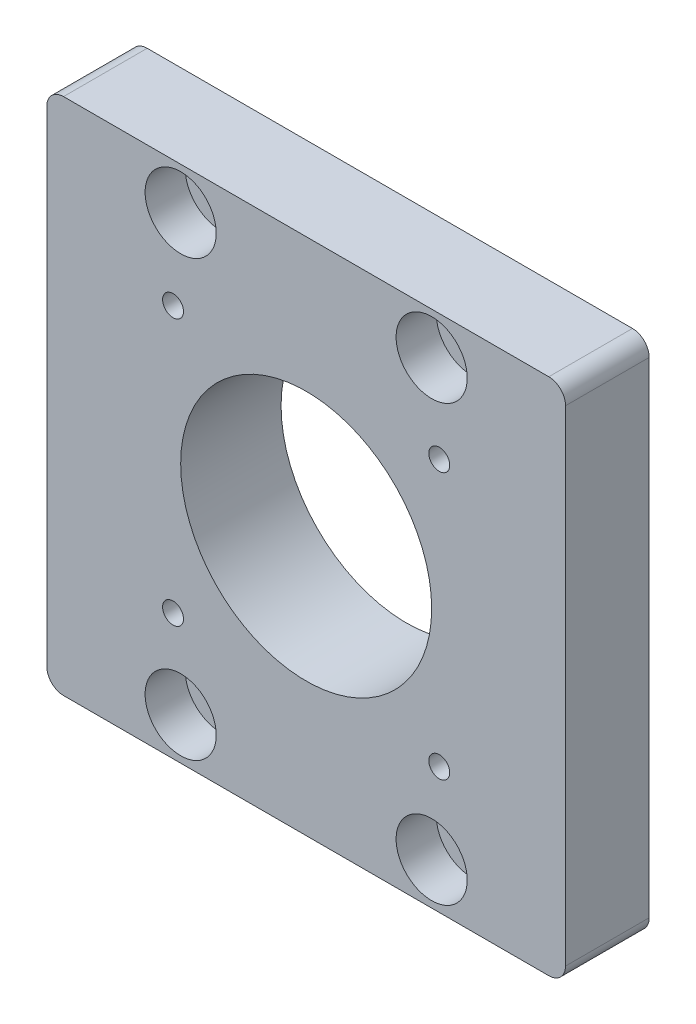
from build123d import *
from build123d.topology import SkipClean

# Parameters (mm, degrees)
SKETCH_1_W          = 62
SKETCH_1_H          = 62
SKETCH_1_R          = 15
EXTRUDE_1_DEPTH     = 10
SKETCH_2_R          = 1.25
CUT_EXTRUDE_1_DEPTH = 45.966654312
SKETCH_5_R          = 2.25
CUT_EXTRUDE_3_DEPTH = 45.966654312
SKETCH_6_R          = 4.25
CUT_EXTRUDE_4_DEPTH = 4.8
FILLET_1_R          = 2
EXTRUDE_START       = 2
SKETCH_7_R          = 25
SKETCH_7_R_2        = 15
EXTRUDE_2_DEPTH     = 2


with BuildPart() as part:
    # Sketch 1 → Extrude 1 (new body)
    with BuildSketch(Plane.XY):
        Rectangle(SKETCH_1_W, SKETCH_1_H)
        Circle(SKETCH_1_R, mode=Mode.SUBTRACT)
    extrude(amount=EXTRUDE_1_DEPTH)

    # Sketch 2 → Cut-Extrude 1 (cut, through all)
    with BuildSketch(Plane.XY.offset(10)):
        with Locations((-15.909902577, 15.909902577)):
            Circle(SKETCH_2_R)
        with Locations((15.909902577, 15.909902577)):
            Circle(SKETCH_2_R)
        with Locations((15.909902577, -15.909902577)):
            Circle(SKETCH_2_R)
        with Locations((-15.909902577, -15.909902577)):
            Circle(SKETCH_2_R)
    extrude(amount=-CUT_EXTRUDE_1_DEPTH, mode=Mode.SUBTRACT)

    # Sketch 5 → Cut-Extrude 3 (cut, through all)
    with BuildSketch(Plane.XY.offset(10)):
        with Locations((-15, 25.980762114)):
            Circle(SKETCH_5_R)
        with Locations((15, 25.980762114)):
            Circle(SKETCH_5_R)
        with Locations((15, -25.980762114)):
            Circle(SKETCH_5_R)
        with Locations((-15, -25.980762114)):
            Circle(SKETCH_5_R)
    extrude(amount=-CUT_EXTRUDE_3_DEPTH, mode=Mode.SUBTRACT)

    # Sketch 6 → Cut-Extrude 4 (cut)
    with BuildSketch(Plane.XY.offset(10)):
        with Locations((-15, 25.980762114)):
            Circle(SKETCH_6_R)
        with Locations((15, 25.980762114)):
            Circle(SKETCH_6_R)
        with Locations((15, -25.980762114)):
            Circle(SKETCH_6_R)
        with Locations((-15, -25.980762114)):
            Circle(SKETCH_6_R)
    extrude(amount=-CUT_EXTRUDE_4_DEPTH, mode=Mode.SUBTRACT)

    # Fillet 1
    fillet_1_edges = [part.edges().sort_by_distance(p)[0] for p in [
        (31, -31, 5),
        (-31, -31, 5),
        (-31, 31, 5),
        (31, 31, 5),
    ]]
    fillet(fillet_1_edges, radius=FILLET_1_R)

    # Sketch 7 → Extrude 2 (add)
    with SkipClean():  # the faces are left unmerged after this step: merging them gives an invalid solid
        with BuildSketch(Plane(origin=(0, 0, 0), x_dir=(-1, 0, 0), z_dir=(0, 0, -1)).offset(EXTRUDE_START)):
            Circle(SKETCH_7_R)
            Circle(SKETCH_7_R_2, mode=Mode.SUBTRACT)
        extrude(amount=-EXTRUDE_2_DEPTH)


solid = part.part
